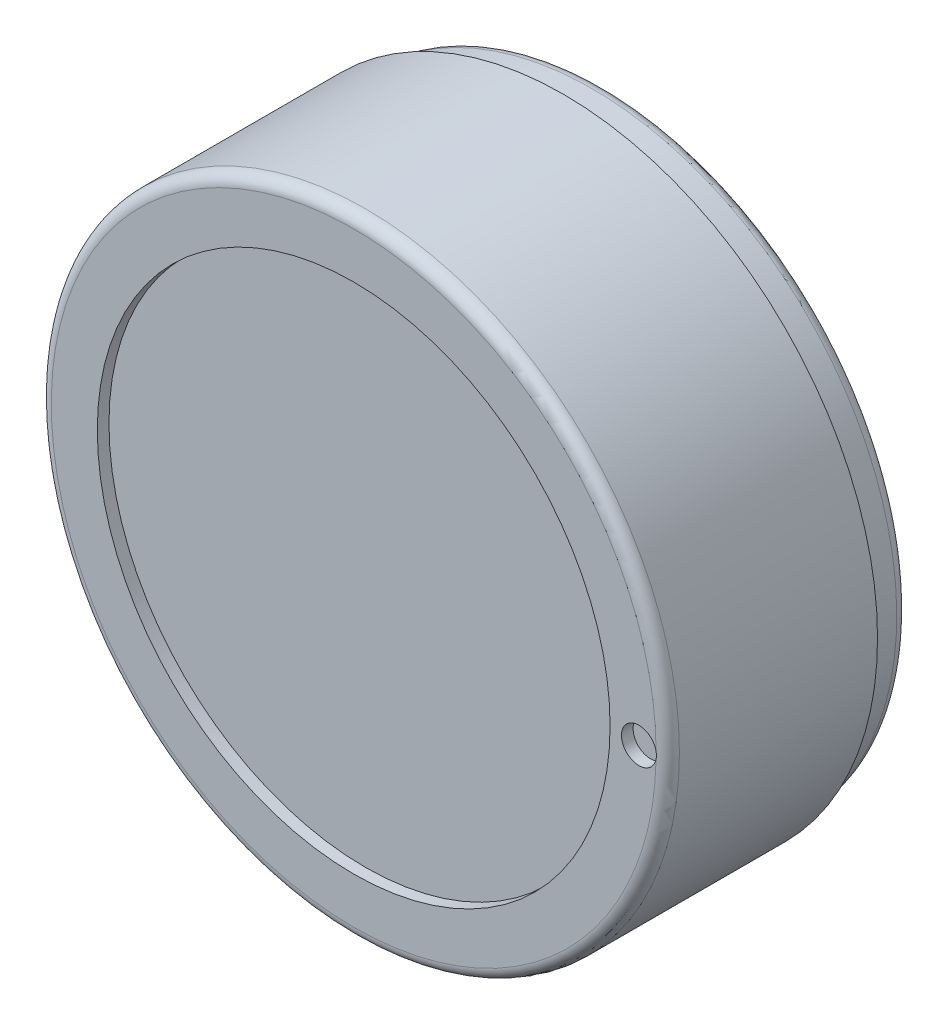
ISO-10303-21;
HEADER;
FILE_DESCRIPTION(('STEP AP214'),'2;1');
FILE_NAME('part.step','',(''),(''),'','','');
FILE_SCHEMA(('AUTOMOTIVE_DESIGN { 1 0 10303 214 1 1 1 1 }'));
ENDSEC;
DATA;
#1=APPLICATION_CONTEXT('core data for automotive mechanical design processes');
#2=APPLICATION_PROTOCOL_DEFINITION('international standard','automotive_design',2000,#1);
#3=PRODUCT_CONTEXT('',#1,'mechanical');
#4=PRODUCT('Part','Part','',(#3));
#5=PRODUCT_RELATED_PRODUCT_CATEGORY('part','',(#4));
#6=PRODUCT_DEFINITION_FORMATION('','',#4);
#7=PRODUCT_DEFINITION_CONTEXT('part definition',#1,'design');
#8=PRODUCT_DEFINITION('design','',#6,#7);
#9=PRODUCT_DEFINITION_SHAPE('','',#8);
#10=(LENGTH_UNIT() NAMED_UNIT(*) SI_UNIT(.MILLI.,.METRE.));
#11=(NAMED_UNIT(*) PLANE_ANGLE_UNIT() SI_UNIT($,.RADIAN.));
#12=(NAMED_UNIT(*) SI_UNIT($,.STERADIAN.) SOLID_ANGLE_UNIT());
#13=UNCERTAINTY_MEASURE_WITH_UNIT(LENGTH_MEASURE(1.E-05),#10,'distance_accuracy_value','');
#14=(GEOMETRIC_REPRESENTATION_CONTEXT(3) GLOBAL_UNCERTAINTY_ASSIGNED_CONTEXT((#13)) GLOBAL_UNIT_ASSIGNED_CONTEXT((#10,
#11,#12)) REPRESENTATION_CONTEXT('',''));
#15=CARTESIAN_POINT('',(0.,0.,0.));
#16=DIRECTION('',(0.,0.,1.));
#17=DIRECTION('',(1.,0.,0.));
#18=AXIS2_PLACEMENT_3D('',#15,#16,#17);
#19=CARTESIAN_POINT('',(-25.9500000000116,0.,21.5));
#20=DIRECTION('',(0.,0.,-1.));
#21=DIRECTION('',(0.,1.,0.));
#22=AXIS2_PLACEMENT_3D('',#19,#20,#21);
#23=PLANE('',#22);
#24=CARTESIAN_POINT('',(0.,0.,21.5));
#25=DIRECTION('',(0.,0.,1.));
#26=DIRECTION('',(0.,-1.,0.));
#27=AXIS2_PLACEMENT_3D('',#24,#25,#26);
#28=CIRCLE('',#27,22.);
#29=CARTESIAN_POINT('',(0.,-22.,21.5));
#30=VERTEX_POINT('',#29);
#31=EDGE_CURVE('E122',#30,#30,#28,.T.);
#32=ORIENTED_EDGE('',*,*,#31,.F.);
#33=EDGE_LOOP('',(#32));
#34=FACE_BOUND('',#33,.T.);
#35=CARTESIAN_POINT('',(24.475,-0.200525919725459,21.5));
#36=DIRECTION('',(0.,0.,-1.));
#37=DIRECTION('',(0.,1.,0.));
#38=AXIS2_PLACEMENT_3D('',#35,#36,#37);
#39=CIRCLE('',#38,1.5);
#40=CARTESIAN_POINT('',(25.9498980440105,0.0727427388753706,21.5));
#41=VERTEX_POINT('',#40);
#42=CARTESIAN_POINT('',(25.945222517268,-0.497924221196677,21.5));
#43=VERTEX_POINT('',#42);
#44=EDGE_CURVE('E120',#41,#43,#39,.F.);
#45=ORIENTED_EDGE('',*,*,#44,.F.);
#46=CARTESIAN_POINT('',(0.,0.,21.5));
#47=DIRECTION('',(0.,0.,1.));
#48=DIRECTION('',(0.,-1.,0.));
#49=AXIS2_PLACEMENT_3D('',#46,#47,#48);
#50=CIRCLE('',#49,25.9500000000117);
#51=EDGE_CURVE('E167',#41,#43,#50,.T.);
#52=ORIENTED_EDGE('',*,*,#51,.T.);
#53=EDGE_LOOP('',(#45,#52));
#54=FACE_BOUND('',#53,.T.);
#55=ADVANCED_FACE('F14',(#34,#54),#23,.F.);
#56=CARTESIAN_POINT('',(0.,0.,20.5));
#57=DIRECTION('',(0.,0.,1.));
#58=DIRECTION('',(0.,-1.,0.));
#59=AXIS2_PLACEMENT_3D('',#56,#57,#58);
#60=TOROIDAL_SURFACE('',#59,25.9500000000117,1.);
#61=CARTESIAN_POINT('',(0.,0.,20.5));
#62=DIRECTION('',(0.,0.,1.));
#63=DIRECTION('',(0.,-1.,0.));
#64=AXIS2_PLACEMENT_3D('',#61,#62,#63);
#65=CIRCLE('',#64,26.9500000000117);
#66=CARTESIAN_POINT('',(0.,-26.9500000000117,20.5));
#67=VERTEX_POINT('',#66);
#68=EDGE_CURVE('E164',#67,#67,#65,.T.);
#69=ORIENTED_EDGE('',*,*,#68,.T.);
#70=EDGE_LOOP('',(#69));
#71=FACE_BOUND('',#70,.T.);
#72=ORIENTED_EDGE('',*,*,#51,.F.);
#73=CARTESIAN_POINT('',(24.9195600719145,1.23208231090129,20.4998));
#74=CARTESIAN_POINT('',(24.9195545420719,1.23208007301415,20.525852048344));
#75=CARTESIAN_POINT('',(24.920585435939,1.23176459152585,20.551892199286));
#76=CARTESIAN_POINT('',(24.9247058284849,1.23047774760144,20.6037939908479));
#77=CARTESIAN_POINT('',(24.9277954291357,1.22950635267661,20.6296556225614));
#78=CARTESIAN_POINT('',(24.9401284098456,1.2255650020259,20.7067220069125));
#79=CARTESIAN_POINT('',(24.9524359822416,1.22156791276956,20.7574233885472));
#80=CARTESIAN_POINT('',(24.9847688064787,1.21029865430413,20.8559651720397));
#81=CARTESIAN_POINT('',(25.004803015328,1.20302268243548,20.903802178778));
#82=CARTESIAN_POINT('',(25.051691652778,1.18441423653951,20.9951127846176));
#83=CARTESIAN_POINT('',(25.0785396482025,1.17308558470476,21.0385904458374));
#84=CARTESIAN_POINT('',(25.1370749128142,1.14582956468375,21.1191056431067));
#85=CARTESIAN_POINT('',(25.1686520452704,1.13000093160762,21.156256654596));
#86=CARTESIAN_POINT('',(25.2352696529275,1.09308741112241,21.2243114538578));
#87=CARTESIAN_POINT('',(25.2703100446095,1.07200265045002,21.2552153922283));
#88=CARTESIAN_POINT('',(25.3412120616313,1.0248135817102,21.3099755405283));
#89=CARTESIAN_POINT('',(25.3770493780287,0.998801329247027,21.3339432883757));
#90=CARTESIAN_POINT('',(25.4482605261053,0.941772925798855,21.3758135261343));
#91=CARTESIAN_POINT('',(25.4836342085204,0.910755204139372,21.3937141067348));
#92=CARTESIAN_POINT('',(25.5551642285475,0.841547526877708,21.4254154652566));
#93=CARTESIAN_POINT('',(25.5911518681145,0.802980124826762,21.4387667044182));
#94=CARTESIAN_POINT('',(25.6594130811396,0.721429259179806,21.4604859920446));
#95=CARTESIAN_POINT('',(25.6916844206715,0.678443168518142,21.4688510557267));
#96=CARTESIAN_POINT('',(25.7575138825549,0.580058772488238,21.4831865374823));
#97=CARTESIAN_POINT('',(25.7900786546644,0.52388130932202,21.4883633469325));
#98=CARTESIAN_POINT('',(25.8477293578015,0.407616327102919,21.4954688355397));
#99=CARTESIAN_POINT('',(25.8728092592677,0.347525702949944,21.4973949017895));
#100=CARTESIAN_POINT('',(25.9192817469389,0.211991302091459,21.4998578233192));
#101=CARTESIAN_POINT('',(25.9388753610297,0.135918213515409,21.5000306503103));
#102=CARTESIAN_POINT('',(25.965956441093,-0.0183478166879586,21.4999631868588));
#103=CARTESIAN_POINT('',(25.973441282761,-0.096541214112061,21.4997228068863));
#104=CARTESIAN_POINT('',(25.9762180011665,-0.258938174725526,21.4996302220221));
#105=CARTESIAN_POINT('',(25.9705698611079,-0.343159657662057,21.4998079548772));
#106=CARTESIAN_POINT('',(25.9452387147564,-0.509533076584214,21.5000619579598));
#107=CARTESIAN_POINT('',(25.9255439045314,-0.591683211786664,21.5001381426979));
#108=CARTESIAN_POINT('',(25.8725748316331,-0.751822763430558,21.4980776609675));
#109=CARTESIAN_POINT('',(25.8392482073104,-0.829794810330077,21.4959324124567));
#110=CARTESIAN_POINT('',(25.7601101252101,-0.978701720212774,21.4859004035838));
#111=CARTESIAN_POINT('',(25.7143210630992,-1.04964889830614,21.4780239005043));
#112=CARTESIAN_POINT('',(25.6273450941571,-1.16261886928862,21.4557293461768));
#113=CARTESIAN_POINT('',(25.5886577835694,-1.20707231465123,21.4438623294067));
#114=CARTESIAN_POINT('',(25.507724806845,-1.28993796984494,21.4131471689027));
#115=CARTESIAN_POINT('',(25.4654828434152,-1.3283563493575,21.3943062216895));
#116=CARTESIAN_POINT('',(25.3793964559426,-1.39851419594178,21.347984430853));
#117=CARTESIAN_POINT('',(25.3355413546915,-1.43019321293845,21.3204304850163));
#118=CARTESIAN_POINT('',(25.2497934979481,-1.48594906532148,21.2560931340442));
#119=CARTESIAN_POINT('',(25.2078994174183,-1.51003109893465,21.2193160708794));
#120=CARTESIAN_POINT('',(25.1348222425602,-1.54815449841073,21.1428028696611));
#121=CARTESIAN_POINT('',(25.1029584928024,-1.56312134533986,21.1041696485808));
#122=CARTESIAN_POINT('',(25.0449410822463,-1.58839165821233,21.0214532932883));
#123=CARTESIAN_POINT('',(25.0187887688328,-1.59869402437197,20.9773688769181));
#124=CARTESIAN_POINT('',(24.9742665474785,-1.61519198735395,20.8866347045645));
#125=CARTESIAN_POINT('',(24.9556651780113,-1.62151365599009,20.8401204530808));
#126=CARTESIAN_POINT('',(24.9257546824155,-1.63128449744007,20.7445423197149));
#127=CARTESIAN_POINT('',(24.9144392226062,-1.63473616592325,20.6954806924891));
#128=CARTESIAN_POINT('',(24.9033103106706,-1.6380802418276,20.6216641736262));
#129=CARTESIAN_POINT('',(24.9005742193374,-1.63889018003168,20.5973544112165));
#130=CARTESIAN_POINT('',(24.8969318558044,-1.63996176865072,20.548633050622));
#131=CARTESIAN_POINT('',(24.8960220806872,-1.64022446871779,20.5242217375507));
#132=CARTESIAN_POINT('',(24.8960269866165,-1.64022598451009,20.4998));
#133=B_SPLINE_CURVE_WITH_KNOTS('',3,(#73,#74,#75,#76,#77,#78,#79,#80,#81,#82,#83,#84,#85,#86,
#87,#88,#89,#90,#91,#92,#93,#94,#95,#96,#97,#98,#99,#100,#101,#102,#103,#104,#105,#106,#107,
#108,#109,#110,#111,#112,#113,#114,#115,#116,#117,#118,#119,#120,#121,#122,#123,#124,#125,#126,
#127,#128,#129,#130,#131,#132),.UNSPECIFIED.,.F.,.F.,(4,2,2,2,2,2,2,2,2,2,2,2,2,2,2,2,2,2,2,2,2,
2,2,2,2,2,2,2,2,4),(0.,0.0781093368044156,0.156222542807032,0.312404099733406,0.468767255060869,
0.624983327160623,0.778006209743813,0.931025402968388,1.0814264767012,1.23187483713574,
1.39450970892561,1.5572418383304,1.75195274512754,1.94682008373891,2.18148282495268,
2.41619641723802,2.66822146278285,2.92045854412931,3.17367373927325,3.42643686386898,
3.60609054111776,3.78555934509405,3.96657573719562,4.14746799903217,4.30347750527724,
4.45952377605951,4.61033989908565,4.76102473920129,4.8343909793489,4.90761636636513),.UNSPECIFIED.);
#134=EDGE_CURVE('E170',#41,#43,#133,.T.);
#135=ORIENTED_EDGE('',*,*,#134,.T.);
#136=EDGE_LOOP('',(#72,#135));
#137=FACE_BOUND('',#136,.T.);
#138=ADVANCED_FACE('F184',(#71,#137),#60,.T.);
#139=CARTESIAN_POINT('',(0.,0.,31.8085085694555));
#140=DIRECTION('',(0.,0.,1.));
#141=DIRECTION('',(0.,-1.,0.));
#142=AXIS2_PLACEMENT_3D('',#139,#140,#141);
#143=CYLINDRICAL_SURFACE('',#142,26.9500000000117);
#144=CARTESIAN_POINT('',(0.,0.,3.5));
#145=DIRECTION('',(0.,0.,1.));
#146=DIRECTION('',(0.,-1.,0.));
#147=AXIS2_PLACEMENT_3D('',#144,#145,#146);
#148=CIRCLE('',#147,26.9500000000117);
#149=CARTESIAN_POINT('',(0.,-26.9500000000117,3.5));
#150=VERTEX_POINT('',#149);
#151=EDGE_CURVE('E161',#150,#150,#148,.T.);
#152=ORIENTED_EDGE('',*,*,#151,.T.);
#153=EDGE_LOOP('',(#152));
#154=FACE_BOUND('',#153,.T.);
#155=ORIENTED_EDGE('',*,*,#68,.F.);
#156=EDGE_LOOP('',(#155));
#157=FACE_BOUND('',#156,.T.);
#158=ADVANCED_FACE('F292',(#154,#157),#143,.T.);
#159=CARTESIAN_POINT('',(-26.9500000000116,0.,3.5));
#160=DIRECTION('',(0.,0.,-1.));
#161=DIRECTION('',(0.,1.,0.));
#162=AXIS2_PLACEMENT_3D('',#159,#160,#161);
#163=PLANE('',#162);
#164=CARTESIAN_POINT('',(0.,0.,3.5));
#165=DIRECTION('',(0.,0.,1.));
#166=DIRECTION('',(0.,-1.,0.));
#167=AXIS2_PLACEMENT_3D('',#164,#165,#166);
#168=CIRCLE('',#167,26.1);
#169=CARTESIAN_POINT('',(0.,-26.1,3.5));
#170=VERTEX_POINT('',#169);
#171=EDGE_CURVE('E158',#170,#170,#168,.T.);
#172=ORIENTED_EDGE('',*,*,#171,.T.);
#173=EDGE_LOOP('',(#172));
#174=FACE_BOUND('',#173,.T.);
#175=ORIENTED_EDGE('',*,*,#151,.F.);
#176=EDGE_LOOP('',(#175));
#177=FACE_BOUND('',#176,.T.);
#178=ADVANCED_FACE('F305',(#174,#177),#163,.T.);
#179=CARTESIAN_POINT('',(0.,0.,31.8085085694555));
#180=DIRECTION('',(0.,0.,1.));
#181=DIRECTION('',(0.,-1.,0.));
#182=AXIS2_PLACEMENT_3D('',#179,#180,#181);
#183=CYLINDRICAL_SURFACE('',#182,26.1);
#184=ORIENTED_EDGE('',*,*,#171,.F.);
#185=EDGE_LOOP('',(#184));
#186=FACE_BOUND('',#185,.T.);
#187=CARTESIAN_POINT('',(0.,0.,1.));
#188=DIRECTION('',(0.,0.,1.));
#189=DIRECTION('',(0.,-1.,0.));
#190=AXIS2_PLACEMENT_3D('',#187,#188,#189);
#191=CIRCLE('',#190,26.1);
#192=CARTESIAN_POINT('',(0.,-26.1,1.));
#193=VERTEX_POINT('',#192);
#194=EDGE_CURVE('E155',#193,#193,#191,.T.);
#195=ORIENTED_EDGE('',*,*,#194,.T.);
#196=EDGE_LOOP('',(#195));
#197=FACE_BOUND('',#196,.T.);
#198=ADVANCED_FACE('F313',(#186,#197),#183,.T.);
#199=CARTESIAN_POINT('',(0.,0.,1.));
#200=DIRECTION('',(0.,0.,1.));
#201=DIRECTION('',(0.,-1.,0.));
#202=AXIS2_PLACEMENT_3D('',#199,#200,#201);
#203=TOROIDAL_SURFACE('',#202,25.1,1.);
#204=CARTESIAN_POINT('',(0.,0.,0.));
#205=DIRECTION('',(0.,0.,1.));
#206=DIRECTION('',(0.,-1.,0.));
#207=AXIS2_PLACEMENT_3D('',#204,#205,#206);
#208=CIRCLE('',#207,25.1);
#209=CARTESIAN_POINT('',(0.,-25.1,0.));
#210=VERTEX_POINT('',#209);
#211=EDGE_CURVE('E152',#210,#210,#208,.T.);
#212=ORIENTED_EDGE('',*,*,#211,.T.);
#213=EDGE_LOOP('',(#212));
#214=FACE_BOUND('',#213,.T.);
#215=ORIENTED_EDGE('',*,*,#194,.F.);
#216=EDGE_LOOP('',(#215));
#217=FACE_BOUND('',#216,.T.);
#218=ADVANCED_FACE('F319',(#214,#217),#203,.T.);
#219=CARTESIAN_POINT('',(-25.1,0.,0.));
#220=DIRECTION('',(0.,0.,-1.));
#221=DIRECTION('',(0.,1.,0.));
#222=AXIS2_PLACEMENT_3D('',#219,#220,#221);
#223=PLANE('',#222);
#224=CARTESIAN_POINT('',(0.,0.,0.));
#225=DIRECTION('',(0.,0.,1.));
#226=DIRECTION('',(0.,-1.,0.));
#227=AXIS2_PLACEMENT_3D('',#224,#225,#226);
#228=CIRCLE('',#227,5.);
#229=CARTESIAN_POINT('',(0.,-5.,0.));
#230=VERTEX_POINT('',#229);
#231=EDGE_CURVE('E149',#230,#230,#228,.T.);
#232=ORIENTED_EDGE('',*,*,#231,.T.);
#233=EDGE_LOOP('',(#232));
#234=FACE_BOUND('',#233,.T.);
#235=ORIENTED_EDGE('',*,*,#211,.F.);
#236=EDGE_LOOP('',(#235));
#237=FACE_BOUND('',#236,.T.);
#238=ADVANCED_FACE('F323',(#234,#237),#223,.T.);
#239=CARTESIAN_POINT('',(0.,0.,31.8085085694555));
#240=DIRECTION('',(0.,0.,1.));
#241=DIRECTION('',(0.,-1.,0.));
#242=AXIS2_PLACEMENT_3D('',#239,#240,#241);
#243=CYLINDRICAL_SURFACE('',#242,5.);
#244=ORIENTED_EDGE('',*,*,#231,.F.);
#245=EDGE_LOOP('',(#244));
#246=FACE_BOUND('',#245,.T.);
#247=CARTESIAN_POINT('',(0.,0.,-0.5));
#248=DIRECTION('',(0.,0.,1.));
#249=DIRECTION('',(0.,-1.,0.));
#250=AXIS2_PLACEMENT_3D('',#247,#248,#249);
#251=CIRCLE('',#250,5.);
#252=CARTESIAN_POINT('',(0.,-5.,-0.5));
#253=VERTEX_POINT('',#252);
#254=EDGE_CURVE('E146',#253,#253,#251,.T.);
#255=ORIENTED_EDGE('',*,*,#254,.T.);
#256=EDGE_LOOP('',(#255));
#257=FACE_BOUND('',#256,.T.);
#258=ADVANCED_FACE('F326',(#246,#257),#243,.T.);
#259=CARTESIAN_POINT('',(-5.,0.,-0.5));
#260=DIRECTION('',(0.,0.,-1.));
#261=DIRECTION('',(0.,1.,0.));
#262=AXIS2_PLACEMENT_3D('',#259,#260,#261);
#263=PLANE('',#262);
#264=ORIENTED_EDGE('',*,*,#254,.F.);
#265=EDGE_LOOP('',(#264));
#266=FACE_BOUND('',#265,.T.);
#267=DIRECTION('',(-1.,0.,0.));
#268=VECTOR('',#267,1.);
#269=CARTESIAN_POINT('',(2.02072594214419,-3.49999999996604,-0.5));
#270=LINE('',#269,#268);
#271=CARTESIAN_POINT('',(2.020725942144,-3.49999999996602,-0.5));
#272=VERTEX_POINT('',#271);
#273=CARTESIAN_POINT('',(-2.020725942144,-3.49999999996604,-0.5));
#274=VERTEX_POINT('',#273);
#275=EDGE_CURVE('E105',#272,#274,#270,.T.);
#276=ORIENTED_EDGE('',*,*,#275,.F.);
#277=DIRECTION('',(0.5,0.866025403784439,0.));
#278=VECTOR('',#277,1.);
#279=CARTESIAN_POINT('',(2.02072594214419,-3.49999999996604,-0.5));
#280=LINE('',#279,#278);
#281=CARTESIAN_POINT('',(4.04145188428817,0.,-0.5));
#282=VERTEX_POINT('',#281);
#283=EDGE_CURVE('E34',#272,#282,#280,.T.);
#284=ORIENTED_EDGE('',*,*,#283,.T.);
#285=DIRECTION('',(0.5,-0.866025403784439,0.));
#286=VECTOR('',#285,1.);
#287=CARTESIAN_POINT('',(2.02072594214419,3.49999999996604,-0.5));
#288=LINE('',#287,#286);
#289=CARTESIAN_POINT('',(2.02072594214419,3.49999999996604,-0.5));
#290=VERTEX_POINT('',#289);
#291=EDGE_CURVE('E80',#290,#282,#288,.T.);
#292=ORIENTED_EDGE('',*,*,#291,.F.);
#293=DIRECTION('',(-1.,0.,0.));
#294=VECTOR('',#293,1.);
#295=CARTESIAN_POINT('',(2.02072594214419,3.49999999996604,-0.5));
#296=LINE('',#295,#294);
#297=CARTESIAN_POINT('',(-2.020725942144,3.49999999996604,-0.5));
#298=VERTEX_POINT('',#297);
#299=EDGE_CURVE('E92',#290,#298,#296,.T.);
#300=ORIENTED_EDGE('',*,*,#299,.T.);
#301=DIRECTION('',(-0.5,-0.866025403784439,0.));
#302=VECTOR('',#301,1.);
#303=CARTESIAN_POINT('',(-2.020725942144,3.49999999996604,-0.5));
#304=LINE('',#303,#302);
#305=CARTESIAN_POINT('',(-4.04145188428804,0.,-0.5));
#306=VERTEX_POINT('',#305);
#307=EDGE_CURVE('E97',#298,#306,#304,.T.);
#308=ORIENTED_EDGE('',*,*,#307,.T.);
#309=DIRECTION('',(-0.5,0.866025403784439,0.));
#310=VECTOR('',#309,1.);
#311=CARTESIAN_POINT('',(-2.020725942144,-3.49999999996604,-0.5));
#312=LINE('',#311,#310);
#313=EDGE_CURVE('E99',#274,#306,#312,.T.);
#314=ORIENTED_EDGE('',*,*,#313,.F.);
#315=EDGE_LOOP('',(#276,#284,#292,#300,#308,#314));
#316=FACE_BOUND('',#315,.T.);
#317=ADVANCED_FACE('F90',(#266,#316),#263,.T.);
#318=CARTESIAN_POINT('',(0.,0.,20.5));
#319=DIRECTION('',(0.,0.,1.));
#320=DIRECTION('',(0.,-1.,0.));
#321=AXIS2_PLACEMENT_3D('',#318,#319,#320);
#322=CYLINDRICAL_SURFACE('',#321,22.);
#323=CARTESIAN_POINT('',(0.,0.,20.5));
#324=DIRECTION('',(0.,0.,1.));
#325=DIRECTION('',(0.,-1.,0.));
#326=AXIS2_PLACEMENT_3D('',#323,#324,#325);
#327=CIRCLE('',#326,22.);
#328=CARTESIAN_POINT('',(0.,-22.,20.5));
#329=VERTEX_POINT('',#328);
#330=EDGE_CURVE('E125',#329,#329,#327,.T.);
#331=ORIENTED_EDGE('',*,*,#330,.F.);
#332=EDGE_LOOP('',(#331));
#333=FACE_BOUND('',#332,.T.);
#334=ORIENTED_EDGE('',*,*,#31,.T.);
#335=EDGE_LOOP('',(#334));
#336=FACE_BOUND('',#335,.T.);
#337=ADVANCED_FACE('F195',(#333,#336),#322,.F.);
#338=CARTESIAN_POINT('',(0.,0.,20.5));
#339=DIRECTION('',(0.,0.,1.));
#340=DIRECTION('',(0.,-1.,0.));
#341=AXIS2_PLACEMENT_3D('',#338,#339,#340);
#342=PLANE('',#341);
#343=ORIENTED_EDGE('',*,*,#330,.T.);
#344=EDGE_LOOP('',(#343));
#345=FACE_BOUND('',#344,.T.);
#346=ADVANCED_FACE('F193',(#345),#342,.T.);
#347=CARTESIAN_POINT('',(24.475,-0.200525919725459,50.5));
#348=DIRECTION('',(0.,0.,-1.));
#349=DIRECTION('',(0.,1.,0.));
#350=AXIS2_PLACEMENT_3D('',#347,#348,#349);
#351=CYLINDRICAL_SURFACE('',#350,1.5);
#352=CARTESIAN_POINT('',(24.475,-0.200525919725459,20.5));
#353=DIRECTION('',(0.,0.,1.));
#354=DIRECTION('',(0.,-1.,0.));
#355=AXIS2_PLACEMENT_3D('',#352,#353,#354);
#356=CIRCLE('',#355,1.5);
#357=CARTESIAN_POINT('',(24.475,-1.70052591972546,20.5));
#358=VERTEX_POINT('',#357);
#359=EDGE_CURVE('E117',#358,#358,#356,.T.);
#360=ORIENTED_EDGE('',*,*,#359,.F.);
#361=EDGE_LOOP('',(#360));
#362=FACE_BOUND('',#361,.T.);
#363=ORIENTED_EDGE('',*,*,#44,.T.);
#364=ORIENTED_EDGE('',*,*,#134,.F.);
#365=EDGE_LOOP('',(#363,#364));
#366=FACE_BOUND('',#365,.T.);
#367=ADVANCED_FACE('F187',(#362,#366),#351,.F.);
#368=CARTESIAN_POINT('',(24.475,-0.200525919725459,20.5));
#369=DIRECTION('',(0.,0.,1.));
#370=DIRECTION('',(0.,-1.,0.));
#371=AXIS2_PLACEMENT_3D('',#368,#369,#370);
#372=PLANE('',#371);
#373=ORIENTED_EDGE('',*,*,#359,.T.);
#374=EDGE_LOOP('',(#373));
#375=FACE_BOUND('',#374,.T.);
#376=ADVANCED_FACE('F192',(#375),#372,.T.);
#377=CARTESIAN_POINT('',(2.02072594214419,-3.49999999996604,-10.5));
#378=DIRECTION('',(0.866025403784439,-0.5,0.));
#379=DIRECTION('',(-0.5,-0.866025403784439,0.));
#380=AXIS2_PLACEMENT_3D('',#377,#378,#379);
#381=PLANE('',#380);
#382=DIRECTION('',(0.,0.,1.));
#383=VECTOR('',#382,1.);
#384=CARTESIAN_POINT('',(4.04145188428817,0.,-10.5));
#385=LINE('',#384,#383);
#386=CARTESIAN_POINT('',(4.04145188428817,0.,-2.52965758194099));
#387=VERTEX_POINT('',#386);
#388=EDGE_CURVE('E41',#387,#282,#385,.T.);
#389=ORIENTED_EDGE('',*,*,#388,.T.);
#390=ORIENTED_EDGE('',*,*,#283,.F.);
#391=DIRECTION('',(0.,0.,1.));
#392=VECTOR('',#391,1.);
#393=CARTESIAN_POINT('',(2.02072594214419,-3.49999999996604,-10.5));
#394=LINE('',#393,#392);
#395=CARTESIAN_POINT('',(2.02072594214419,-3.49999999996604,-2.52965758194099));
#396=VERTEX_POINT('',#395);
#397=EDGE_CURVE('E114',#396,#272,#394,.T.);
#398=ORIENTED_EDGE('',*,*,#397,.F.);
#399=CARTESIAN_POINT('',(4.04156735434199,0.000200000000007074,-2.529590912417));
#400=CARTESIAN_POINT('',(3.95276673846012,-0.153607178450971,-2.58087918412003));
#401=CARTESIAN_POINT('',(3.86319960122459,-0.308742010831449,-2.62752401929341));
#402=CARTESIAN_POINT('',(3.68251437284,-0.621698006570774,-2.70894309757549));
#403=CARTESIAN_POINT('',(3.5913930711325,-0.779524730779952,-2.74368853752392));
#404=CARTESIAN_POINT('',(3.41027974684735,-1.09322221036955,-2.79777494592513));
#405=CARTESIAN_POINT('',(3.32031559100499,-1.24904469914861,-2.81747588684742));
#406=CARTESIAN_POINT('',(3.13996396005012,-1.56142288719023,-2.84099484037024));
#407=CARTESIAN_POINT('',(3.04957714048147,-1.71797745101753,-2.84483232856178));
#408=CARTESIAN_POINT('',(2.88068384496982,-2.01050921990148,-2.83684967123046));
#409=CARTESIAN_POINT('',(2.80215208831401,-2.14653021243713,-2.82698953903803));
#410=CARTESIAN_POINT('',(2.64560020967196,-2.41768602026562,-2.79573850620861));
#411=CARTESIAN_POINT('',(2.56758062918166,-2.55281989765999,-2.77433692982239));
#412=CARTESIAN_POINT('',(2.41070596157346,-2.82453479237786,-2.72083456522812));
#413=CARTESIAN_POINT('',(2.33187072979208,-2.9610814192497,-2.68850697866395));
#414=CARTESIAN_POINT('',(2.17537608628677,-3.23213809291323,-2.61513603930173));
#415=CARTESIAN_POINT('',(2.09771466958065,-3.36665161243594,-2.5741099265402));
#416=CARTESIAN_POINT('',(2.02061047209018,-3.50019999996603,-2.529590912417));
#417=B_SPLINE_CURVE_WITH_KNOTS('',3,(#399,#400,#401,#402,#403,#404,#405,#406,#407,#408,#409,
#410,#411,#412,#413,#414,#415,#416),.UNSPECIFIED.,.F.,.F.,(4,2,2,2,2,2,2,2,4),(0.,
0.554793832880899,1.11092123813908,1.65328467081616,2.19498204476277,2.66665130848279,
3.13875761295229,3.62133612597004,4.10296698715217),.UNSPECIFIED.);
#418=EDGE_CURVE('E9',#387,#396,#417,.T.);
#419=ORIENTED_EDGE('',*,*,#418,.F.);
#420=EDGE_LOOP('',(#389,#390,#398,#419));
#421=FACE_BOUND('',#420,.T.);
#422=ADVANCED_FACE('F265',(#421),#381,.T.);
#423=CARTESIAN_POINT('',(2.02072594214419,-3.49999999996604,-10.5));
#424=DIRECTION('',(0.,1.,0.));
#425=DIRECTION('',(0.,0.,1.));
#426=AXIS2_PLACEMENT_3D('',#423,#424,#425);
#427=PLANE('',#426);
#428=CARTESIAN_POINT('',(-5.35125920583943,-3.49999999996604,-1.17128963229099));
#429=CARTESIAN_POINT('',(-5.19765156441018,-3.49999999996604,-1.24548805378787));
#430=CARTESIAN_POINT('',(-5.04367983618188,-3.49999999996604,-1.31894642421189));
#431=CARTESIAN_POINT('',(-4.73481130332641,-3.49999999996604,-1.46395998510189));
#432=CARTESIAN_POINT('',(-4.579914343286,-3.49999999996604,-1.53551484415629));
#433=CARTESIAN_POINT('',(-4.26815774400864,-3.49999999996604,-1.67667700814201));
#434=CARTESIAN_POINT('',(-4.11129194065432,-3.49999999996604,-1.74627074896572));
#435=CARTESIAN_POINT('',(-3.79626807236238,-3.49999999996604,-1.8824574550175));
#436=CARTESIAN_POINT('',(-3.63811007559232,-3.49999999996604,-1.94905057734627));
#437=CARTESIAN_POINT('',(-3.31832417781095,-3.49999999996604,-2.07921312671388));
#438=CARTESIAN_POINT('',(-3.15667742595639,-3.49999999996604,-2.14273649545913));
#439=CARTESIAN_POINT('',(-2.83147443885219,-3.49999999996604,-2.26478807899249));
#440=CARTESIAN_POINT('',(-2.66791799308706,-3.49999999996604,-2.32331573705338));
#441=CARTESIAN_POINT('',(-2.33897401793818,-3.49999999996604,-2.43379742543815));
#442=CARTESIAN_POINT('',(-2.1735912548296,-3.49999999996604,-2.48576550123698));
#443=CARTESIAN_POINT('',(-1.84047500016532,-3.49999999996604,-2.58143509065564));
#444=CARTESIAN_POINT('',(-1.67274227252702,-3.49999999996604,-2.62513922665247));
#445=CARTESIAN_POINT('',(-1.3348082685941,-3.49999999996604,-2.70215491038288));
#446=CARTESIAN_POINT('',(-1.16460625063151,-3.49999999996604,-2.73546326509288));
#447=CARTESIAN_POINT('',(-0.822159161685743,-3.49999999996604,-2.7894378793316));
#448=CARTESIAN_POINT('',(-0.649914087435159,-3.49999999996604,-2.81010411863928));
#449=CARTESIAN_POINT('',(-0.305367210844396,-3.49999999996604,-2.83696606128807));
#450=CARTESIAN_POINT('',(-0.133072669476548,-3.49999999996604,-2.84325253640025));
#451=CARTESIAN_POINT('',(0.211382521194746,-3.49999999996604,-2.84102452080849));
#452=CARTESIAN_POINT('',(0.383543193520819,-3.49999999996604,-2.83251383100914));
#453=CARTESIAN_POINT('',(0.677785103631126,-3.49999999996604,-2.80591966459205));
#454=CARTESIAN_POINT('',(0.800191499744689,-3.49999999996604,-2.79124480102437));
#455=CARTESIAN_POINT('',(1.04405334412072,-3.49999999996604,-2.75537347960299));
#456=CARTESIAN_POINT('',(1.16550863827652,-3.49999999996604,-2.73417598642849));
#457=CARTESIAN_POINT('',(1.52835176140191,-3.49999999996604,-2.66191271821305));
#458=CARTESIAN_POINT('',(1.76803258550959,-3.49999999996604,-2.60219494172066));
#459=CARTESIAN_POINT('',(2.12666286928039,-3.49999999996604,-2.49926608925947));
#460=CARTESIAN_POINT('',(2.24748336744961,-3.49999999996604,-2.46220910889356));
#461=CARTESIAN_POINT('',(2.48786312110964,-3.49999999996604,-2.38444536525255));
#462=CARTESIAN_POINT('',(2.60742318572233,-3.49999999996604,-2.34374112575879));
#463=CARTESIAN_POINT('',(2.8447820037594,-3.49999999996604,-2.25952849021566));
#464=CARTESIAN_POINT('',(2.96258688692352,-3.49999999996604,-2.21603719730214));
#465=CARTESIAN_POINT('',(3.19728410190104,-3.49999999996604,-2.12651293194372));
#466=CARTESIAN_POINT('',(3.31417604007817,-3.49999999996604,-2.08047892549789));
#467=CARTESIAN_POINT('',(3.43064607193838,-3.49999999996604,-2.03342484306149));
#468=B_SPLINE_CURVE_WITH_KNOTS('',3,(#428,#429,#430,#431,#432,#433,#434,#435,#436,#437,#438,
#439,#440,#441,#442,#443,#444,#445,#446,#447,#448,#449,#450,#451,#452,#453,#454,#455,#456,#457,
#458,#459,#460,#461,#462,#463,#464,#465,#466,#467),.UNSPECIFIED.,.F.,.F.,(4,2,2,2,2,2,2,2,2,2,2,
2,2,2,2,2,2,2,2,4),(0.,0.511774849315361,1.02363822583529,1.53844479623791,2.05322438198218,
2.57420186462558,3.09523732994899,3.61513750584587,4.13487242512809,4.6547668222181,
5.17466205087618,5.69126629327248,6.20773785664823,6.57740592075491,6.94713269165,
7.6871393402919,8.06623653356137,8.44507340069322,8.82177445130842,9.19862983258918),.UNSPECIFIED.);
#469=CARTESIAN_POINT('',(-2.020725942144,-3.49999999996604,-2.52965758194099));
#470=VERTEX_POINT('',#469);
#471=EDGE_CURVE('E27',#470,#396,#468,.T.);
#472=ORIENTED_EDGE('',*,*,#471,.T.);
#473=ORIENTED_EDGE('',*,*,#397,.T.);
#474=ORIENTED_EDGE('',*,*,#275,.T.);
#475=DIRECTION('',(0.,0.,1.));
#476=VECTOR('',#475,1.);
#477=CARTESIAN_POINT('',(-2.020725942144,-3.49999999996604,-10.5));
#478=LINE('',#477,#476);
#479=EDGE_CURVE('E112',#470,#274,#478,.T.);
#480=ORIENTED_EDGE('',*,*,#479,.F.);
#481=EDGE_LOOP('',(#472,#473,#474,#480));
#482=FACE_BOUND('',#481,.T.);
#483=ADVANCED_FACE('F261',(#482),#427,.F.);
#484=CARTESIAN_POINT('',(-2.020725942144,-3.49999999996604,-10.5));
#485=DIRECTION('',(0.866025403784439,0.5,0.));
#486=DIRECTION('',(0.5,-0.866025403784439,0.));
#487=AXIS2_PLACEMENT_3D('',#484,#485,#486);
#488=PLANE('',#487);
#489=CARTESIAN_POINT('',(-4.04156735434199,0.000200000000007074,-2.529590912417));
#490=CARTESIAN_POINT('',(-3.95276673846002,-0.153607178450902,-2.58087918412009));
#491=CARTESIAN_POINT('',(-3.86319960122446,-0.308742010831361,-2.62752401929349));
#492=CARTESIAN_POINT('',(-3.68251437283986,-0.621698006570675,-2.70894309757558));
#493=CARTESIAN_POINT('',(-3.59139307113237,-0.779524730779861,-2.743688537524));
#494=CARTESIAN_POINT('',(-3.41027974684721,-1.09322221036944,-2.79777494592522));
#495=CARTESIAN_POINT('',(-3.32031559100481,-1.24904469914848,-2.81747588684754));
#496=CARTESIAN_POINT('',(-3.13996396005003,-1.56142288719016,-2.84099484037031));
#497=CARTESIAN_POINT('',(-3.0495771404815,-1.71797745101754,-2.84483232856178));
#498=CARTESIAN_POINT('',(-2.88068384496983,-2.01050921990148,-2.83684967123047));
#499=CARTESIAN_POINT('',(-2.80215208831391,-2.14653021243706,-2.8269895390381));
#500=CARTESIAN_POINT('',(-2.64560020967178,-2.41768602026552,-2.79573850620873));
#501=CARTESIAN_POINT('',(-2.56758062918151,-2.5528198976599,-2.77433692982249));
#502=CARTESIAN_POINT('',(-2.41070596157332,-2.82453479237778,-2.72083456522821));
#503=CARTESIAN_POINT('',(-2.33187072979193,-2.96108141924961,-2.68850697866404));
#504=CARTESIAN_POINT('',(-2.17537608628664,-3.23213809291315,-2.61513603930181));
#505=CARTESIAN_POINT('',(-2.09771466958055,-3.36665161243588,-2.57410992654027));
#506=CARTESIAN_POINT('',(-2.02061047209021,-3.50019999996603,-2.529590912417));
#507=B_SPLINE_CURVE_WITH_KNOTS('',3,(#489,#490,#491,#492,#493,#494,#495,#496,#497,#498,#499,
#500,#501,#502,#503,#504,#505,#506),.UNSPECIFIED.,.F.,.F.,(4,2,2,2,2,2,2,2,4),(0.,
0.554793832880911,1.11092123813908,1.65328467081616,2.19498204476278,2.6666513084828,
3.13875761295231,3.62133612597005,4.1029669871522),.UNSPECIFIED.);
#508=CARTESIAN_POINT('',(-4.04145188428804,0.,-2.52965758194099));
#509=VERTEX_POINT('',#508);
#510=EDGE_CURVE('E251',#509,#470,#507,.T.);
#511=ORIENTED_EDGE('',*,*,#510,.T.);
#512=ORIENTED_EDGE('',*,*,#479,.T.);
#513=ORIENTED_EDGE('',*,*,#313,.T.);
#514=DIRECTION('',(0.,0.,1.));
#515=VECTOR('',#514,1.);
#516=CARTESIAN_POINT('',(-4.04145188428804,0.,-10.5));
#517=LINE('',#516,#515);
#518=EDGE_CURVE('E110',#509,#306,#517,.T.);
#519=ORIENTED_EDGE('',*,*,#518,.F.);
#520=EDGE_LOOP('',(#511,#512,#513,#519));
#521=FACE_BOUND('',#520,.T.);
#522=ADVANCED_FACE('F264',(#521),#488,.F.);
#523=CARTESIAN_POINT('',(-2.020725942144,3.49999999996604,-10.5));
#524=DIRECTION('',(-0.866025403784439,0.5,0.));
#525=DIRECTION('',(0.5,0.866025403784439,0.));
#526=AXIS2_PLACEMENT_3D('',#523,#524,#525);
#527=PLANE('',#526);
#528=ORIENTED_EDGE('',*,*,#518,.T.);
#529=ORIENTED_EDGE('',*,*,#307,.F.);
#530=DIRECTION('',(0.,0.,1.));
#531=VECTOR('',#530,1.);
#532=CARTESIAN_POINT('',(-2.020725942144,3.49999999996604,-10.5));
#533=LINE('',#532,#531);
#534=CARTESIAN_POINT('',(-2.020725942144,3.49999999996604,-2.52965758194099));
#535=VERTEX_POINT('',#534);
#536=EDGE_CURVE('E86',#535,#298,#533,.T.);
#537=ORIENTED_EDGE('',*,*,#536,.F.);
#538=CARTESIAN_POINT('',(-4.04156735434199,-0.000200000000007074,-2.529590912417));
#539=CARTESIAN_POINT('',(-3.95276673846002,0.153607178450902,-2.58087918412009));
#540=CARTESIAN_POINT('',(-3.86319960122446,0.308742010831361,-2.62752401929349));
#541=CARTESIAN_POINT('',(-3.68251437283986,0.621698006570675,-2.70894309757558));
#542=CARTESIAN_POINT('',(-3.59139307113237,0.779524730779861,-2.743688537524));
#543=CARTESIAN_POINT('',(-3.41027974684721,1.09322221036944,-2.79777494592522));
#544=CARTESIAN_POINT('',(-3.32031559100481,1.24904469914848,-2.81747588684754));
#545=CARTESIAN_POINT('',(-3.13996396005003,1.56142288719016,-2.84099484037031));
#546=CARTESIAN_POINT('',(-3.0495771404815,1.71797745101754,-2.84483232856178));
#547=CARTESIAN_POINT('',(-2.88068384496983,2.01050921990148,-2.83684967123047));
#548=CARTESIAN_POINT('',(-2.80215208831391,2.14653021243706,-2.8269895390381));
#549=CARTESIAN_POINT('',(-2.64560020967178,2.41768602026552,-2.79573850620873));
#550=CARTESIAN_POINT('',(-2.56758062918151,2.5528198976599,-2.77433692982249));
#551=CARTESIAN_POINT('',(-2.41070596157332,2.82453479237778,-2.72083456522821));
#552=CARTESIAN_POINT('',(-2.33187072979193,2.96108141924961,-2.68850697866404));
#553=CARTESIAN_POINT('',(-2.17537608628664,3.23213809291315,-2.61513603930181));
#554=CARTESIAN_POINT('',(-2.09771466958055,3.36665161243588,-2.57410992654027));
#555=CARTESIAN_POINT('',(-2.02061047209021,3.50019999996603,-2.529590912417));
#556=B_SPLINE_CURVE_WITH_KNOTS('',3,(#538,#539,#540,#541,#542,#543,#544,#545,#546,#547,#548,
#549,#550,#551,#552,#553,#554,#555),.UNSPECIFIED.,.F.,.F.,(4,2,2,2,2,2,2,2,4),(0.,
0.554793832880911,1.11092123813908,1.65328467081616,2.19498204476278,2.6666513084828,
3.13875761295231,3.62133612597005,4.1029669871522),.UNSPECIFIED.);
#557=EDGE_CURVE('E244',#509,#535,#556,.T.);
#558=ORIENTED_EDGE('',*,*,#557,.F.);
#559=EDGE_LOOP('',(#528,#529,#537,#558));
#560=FACE_BOUND('',#559,.T.);
#561=ADVANCED_FACE('F269',(#560),#527,.T.);
#562=CARTESIAN_POINT('',(2.02072594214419,3.49999999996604,-10.5));
#563=DIRECTION('',(0.,1.,0.));
#564=DIRECTION('',(0.,0.,1.));
#565=AXIS2_PLACEMENT_3D('',#562,#563,#564);
#566=PLANE('',#565);
#567=ORIENTED_EDGE('',*,*,#536,.T.);
#568=ORIENTED_EDGE('',*,*,#299,.F.);
#569=DIRECTION('',(0.,0.,1.));
#570=VECTOR('',#569,1.);
#571=CARTESIAN_POINT('',(2.02072594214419,3.49999999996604,-10.5));
#572=LINE('',#571,#570);
#573=CARTESIAN_POINT('',(2.02072594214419,3.49999999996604,-2.52965758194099));
#574=VERTEX_POINT('',#573);
#575=EDGE_CURVE('E77',#574,#290,#572,.T.);
#576=ORIENTED_EDGE('',*,*,#575,.F.);
#577=CARTESIAN_POINT('',(-5.35125920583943,3.49999999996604,-1.17128963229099));
#578=CARTESIAN_POINT('',(-5.19765156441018,3.49999999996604,-1.24548805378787));
#579=CARTESIAN_POINT('',(-5.04367983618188,3.49999999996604,-1.31894642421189));
#580=CARTESIAN_POINT('',(-4.73481130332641,3.49999999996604,-1.46395998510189));
#581=CARTESIAN_POINT('',(-4.579914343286,3.49999999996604,-1.53551484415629));
#582=CARTESIAN_POINT('',(-4.26815774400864,3.49999999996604,-1.67667700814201));
#583=CARTESIAN_POINT('',(-4.11129194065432,3.49999999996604,-1.74627074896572));
#584=CARTESIAN_POINT('',(-3.79626807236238,3.49999999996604,-1.8824574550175));
#585=CARTESIAN_POINT('',(-3.63811007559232,3.49999999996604,-1.94905057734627));
#586=CARTESIAN_POINT('',(-3.31832417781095,3.49999999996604,-2.07921312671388));
#587=CARTESIAN_POINT('',(-3.15667742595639,3.49999999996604,-2.14273649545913));
#588=CARTESIAN_POINT('',(-2.83147443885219,3.49999999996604,-2.26478807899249));
#589=CARTESIAN_POINT('',(-2.66791799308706,3.49999999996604,-2.32331573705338));
#590=CARTESIAN_POINT('',(-2.33897401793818,3.49999999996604,-2.43379742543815));
#591=CARTESIAN_POINT('',(-2.1735912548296,3.49999999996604,-2.48576550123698));
#592=CARTESIAN_POINT('',(-1.84047500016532,3.49999999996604,-2.58143509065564));
#593=CARTESIAN_POINT('',(-1.67274227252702,3.49999999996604,-2.62513922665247));
#594=CARTESIAN_POINT('',(-1.3348082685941,3.49999999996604,-2.70215491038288));
#595=CARTESIAN_POINT('',(-1.16460625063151,3.49999999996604,-2.73546326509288));
#596=CARTESIAN_POINT('',(-0.822159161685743,3.49999999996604,-2.7894378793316));
#597=CARTESIAN_POINT('',(-0.649914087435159,3.49999999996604,-2.81010411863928));
#598=CARTESIAN_POINT('',(-0.305367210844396,3.49999999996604,-2.83696606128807));
#599=CARTESIAN_POINT('',(-0.133072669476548,3.49999999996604,-2.84325253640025));
#600=CARTESIAN_POINT('',(0.211382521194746,3.49999999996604,-2.84102452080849));
#601=CARTESIAN_POINT('',(0.383543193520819,3.49999999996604,-2.83251383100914));
#602=CARTESIAN_POINT('',(0.677785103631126,3.49999999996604,-2.80591966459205));
#603=CARTESIAN_POINT('',(0.800191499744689,3.49999999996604,-2.79124480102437));
#604=CARTESIAN_POINT('',(1.04405334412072,3.49999999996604,-2.75537347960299));
#605=CARTESIAN_POINT('',(1.16550863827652,3.49999999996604,-2.73417598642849));
#606=CARTESIAN_POINT('',(1.52835176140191,3.49999999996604,-2.66191271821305));
#607=CARTESIAN_POINT('',(1.76803258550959,3.49999999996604,-2.60219494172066));
#608=CARTESIAN_POINT('',(2.12666286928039,3.49999999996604,-2.49926608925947));
#609=CARTESIAN_POINT('',(2.24748336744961,3.49999999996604,-2.46220910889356));
#610=CARTESIAN_POINT('',(2.48786312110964,3.49999999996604,-2.38444536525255));
#611=CARTESIAN_POINT('',(2.60742318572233,3.49999999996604,-2.34374112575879));
#612=CARTESIAN_POINT('',(2.8447820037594,3.49999999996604,-2.25952849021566));
#613=CARTESIAN_POINT('',(2.96258688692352,3.49999999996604,-2.21603719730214));
#614=CARTESIAN_POINT('',(3.19728410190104,3.49999999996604,-2.12651293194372));
#615=CARTESIAN_POINT('',(3.31417604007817,3.49999999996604,-2.08047892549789));
#616=CARTESIAN_POINT('',(3.43064607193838,3.49999999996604,-2.03342484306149));
#617=B_SPLINE_CURVE_WITH_KNOTS('',3,(#577,#578,#579,#580,#581,#582,#583,#584,#585,#586,#587,
#588,#589,#590,#591,#592,#593,#594,#595,#596,#597,#598,#599,#600,#601,#602,#603,#604,#605,#606,
#607,#608,#609,#610,#611,#612,#613,#614,#615,#616),.UNSPECIFIED.,.F.,.F.,(4,2,2,2,2,2,2,2,2,2,2,
2,2,2,2,2,2,2,2,4),(0.,0.511774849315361,1.02363822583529,1.53844479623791,2.05322438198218,
2.57420186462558,3.09523732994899,3.61513750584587,4.13487242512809,4.6547668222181,
5.17466205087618,5.69126629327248,6.20773785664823,6.57740592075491,6.94713269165,
7.6871393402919,8.06623653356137,8.44507340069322,8.82177445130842,9.19862983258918),.UNSPECIFIED.);
#618=EDGE_CURVE('E236',#535,#574,#617,.T.);
#619=ORIENTED_EDGE('',*,*,#618,.F.);
#620=EDGE_LOOP('',(#567,#568,#576,#619));
#621=FACE_BOUND('',#620,.T.);
#622=ADVANCED_FACE('F95',(#621),#566,.T.);
#623=CARTESIAN_POINT('',(2.02072594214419,3.49999999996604,-10.5));
#624=DIRECTION('',(-0.866025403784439,-0.5,0.));
#625=DIRECTION('',(-0.5,0.866025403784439,0.));
#626=AXIS2_PLACEMENT_3D('',#623,#624,#625);
#627=PLANE('',#626);
#628=CARTESIAN_POINT('',(4.04156735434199,-0.000200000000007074,-2.529590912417));
#629=CARTESIAN_POINT('',(3.95276673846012,0.153607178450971,-2.58087918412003));
#630=CARTESIAN_POINT('',(3.86319960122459,0.308742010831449,-2.62752401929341));
#631=CARTESIAN_POINT('',(3.68251437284,0.621698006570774,-2.70894309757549));
#632=CARTESIAN_POINT('',(3.5913930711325,0.779524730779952,-2.74368853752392));
#633=CARTESIAN_POINT('',(3.41027974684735,1.09322221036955,-2.79777494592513));
#634=CARTESIAN_POINT('',(3.32031559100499,1.24904469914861,-2.81747588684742));
#635=CARTESIAN_POINT('',(3.13996396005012,1.56142288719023,-2.84099484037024));
#636=CARTESIAN_POINT('',(3.04957714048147,1.71797745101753,-2.84483232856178));
#637=CARTESIAN_POINT('',(2.88068384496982,2.01050921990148,-2.83684967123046));
#638=CARTESIAN_POINT('',(2.80215208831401,2.14653021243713,-2.82698953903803));
#639=CARTESIAN_POINT('',(2.64560020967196,2.41768602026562,-2.79573850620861));
#640=CARTESIAN_POINT('',(2.56758062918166,2.55281989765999,-2.77433692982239));
#641=CARTESIAN_POINT('',(2.41070596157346,2.82453479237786,-2.72083456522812));
#642=CARTESIAN_POINT('',(2.33187072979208,2.9610814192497,-2.68850697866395));
#643=CARTESIAN_POINT('',(2.17537608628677,3.23213809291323,-2.61513603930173));
#644=CARTESIAN_POINT('',(2.09771466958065,3.36665161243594,-2.5741099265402));
#645=CARTESIAN_POINT('',(2.02061047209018,3.50019999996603,-2.529590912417));
#646=B_SPLINE_CURVE_WITH_KNOTS('',3,(#628,#629,#630,#631,#632,#633,#634,#635,#636,#637,#638,
#639,#640,#641,#642,#643,#644,#645),.UNSPECIFIED.,.F.,.F.,(4,2,2,2,2,2,2,2,4),(0.,
0.554793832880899,1.11092123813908,1.65328467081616,2.19498204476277,2.66665130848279,
3.13875761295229,3.62133612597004,4.10296698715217),.UNSPECIFIED.);
#647=EDGE_CURVE('E82',#387,#574,#646,.T.);
#648=ORIENTED_EDGE('',*,*,#647,.T.);
#649=ORIENTED_EDGE('',*,*,#575,.T.);
#650=ORIENTED_EDGE('',*,*,#291,.T.);
#651=ORIENTED_EDGE('',*,*,#388,.F.);
#652=EDGE_LOOP('',(#648,#649,#650,#651));
#653=FACE_BOUND('',#652,.T.);
#654=ADVANCED_FACE('F79',(#653),#627,.F.);
#655=CARTESIAN_POINT('',(-1.2,0.,-3.5));
#656=DIRECTION('',(0.,0.,-1.));
#657=DIRECTION('',(0.,1.,0.));
#658=AXIS2_PLACEMENT_3D('',#655,#656,#657);
#659=PLANE('',#658);
#660=CARTESIAN_POINT('',(0.,0.,-3.5));
#661=DIRECTION('',(0.,0.,1.));
#662=DIRECTION('',(0.,-1.,0.));
#663=AXIS2_PLACEMENT_3D('',#660,#661,#662);
#664=CIRCLE('',#663,1.20000000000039);
#665=CARTESIAN_POINT('',(0.,-1.20000000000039,-3.5));
#666=VERTEX_POINT('',#665);
#667=EDGE_CURVE('E128',#666,#666,#664,.T.);
#668=ORIENTED_EDGE('',*,*,#667,.F.);
#669=EDGE_LOOP('',(#668));
#670=FACE_BOUND('',#669,.T.);
#671=ADVANCED_FACE('F203',(#670),#659,.T.);
#672=CARTESIAN_POINT('',(0.,0.,-3.5));
#673=DIRECTION('',(0.,0.,1.));
#674=DIRECTION('',(0.,-1.,0.));
#675=AXIS2_PLACEMENT_3D('',#672,#673,#674);
#676=CONICAL_SURFACE('',#675,1.20000000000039,0.785398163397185);
#677=CARTESIAN_POINT('',(0.,0.,-3.07899999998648));
#678=DIRECTION('',(0.,0.,1.));
#679=DIRECTION('',(0.,-1.,0.));
#680=AXIS2_PLACEMENT_3D('',#677,#678,#679);
#681=CIRCLE('',#680,1.62100000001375);
#682=CARTESIAN_POINT('',(0.,-1.62100000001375,-3.07899999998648));
#683=VERTEX_POINT('',#682);
#684=EDGE_CURVE('E131',#683,#683,#681,.T.);
#685=ORIENTED_EDGE('',*,*,#684,.F.);
#686=EDGE_LOOP('',(#685));
#687=FACE_BOUND('',#686,.T.);
#688=ORIENTED_EDGE('',*,*,#667,.T.);
#689=EDGE_LOOP('',(#688));
#690=FACE_BOUND('',#689,.T.);
#691=ADVANCED_FACE('F206',(#687,#690),#676,.T.);
#692=CARTESIAN_POINT('',(0.,0.,31.8085085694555));
#693=DIRECTION('',(0.,0.,1.));
#694=DIRECTION('',(0.,-1.,0.));
#695=AXIS2_PLACEMENT_3D('',#692,#693,#694);
#696=CYLINDRICAL_SURFACE('',#695,1.62100000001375);
#697=CARTESIAN_POINT('',(0.,0.,-2.9));
#698=DIRECTION('',(0.,0.,1.));
#699=DIRECTION('',(0.,-1.,0.));
#700=AXIS2_PLACEMENT_3D('',#697,#698,#699);
#701=CIRCLE('',#700,1.62100000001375);
#702=CARTESIAN_POINT('',(0.,-1.62100000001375,-2.9));
#703=VERTEX_POINT('',#702);
#704=EDGE_CURVE('E134',#703,#703,#701,.T.);
#705=ORIENTED_EDGE('',*,*,#704,.F.);
#706=EDGE_LOOP('',(#705));
#707=FACE_BOUND('',#706,.T.);
#708=ORIENTED_EDGE('',*,*,#684,.T.);
#709=EDGE_LOOP('',(#708));
#710=FACE_BOUND('',#709,.T.);
#711=ADVANCED_FACE('F210',(#707,#710),#696,.T.);
#712=CARTESIAN_POINT('',(-1.6210000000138,0.,-2.9));
#713=DIRECTION('',(0.,0.,1.));
#714=DIRECTION('',(0.,-1.,0.));
#715=AXIS2_PLACEMENT_3D('',#712,#713,#714);
#716=PLANE('',#715);
#717=CARTESIAN_POINT('',(0.,0.,-2.90000000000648));
#718=DIRECTION('',(0.,0.,1.));
#719=DIRECTION('',(0.,-1.,0.));
#720=AXIS2_PLACEMENT_3D('',#717,#718,#719);
#721=CIRCLE('',#720,2.97808889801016);
#722=CARTESIAN_POINT('',(0.,-2.97808889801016,-2.90000000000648));
#723=VERTEX_POINT('',#722);
#724=EDGE_CURVE('E137',#723,#723,#721,.T.);
#725=ORIENTED_EDGE('',*,*,#724,.F.);
#726=EDGE_LOOP('',(#725));
#727=FACE_BOUND('',#726,.T.);
#728=ORIENTED_EDGE('',*,*,#704,.T.);
#729=EDGE_LOOP('',(#728));
#730=FACE_BOUND('',#729,.T.);
#731=ADVANCED_FACE('F214',(#727,#730),#716,.F.);
#732=CARTESIAN_POINT('',(0.,0.,-1.33750401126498));
#733=DIRECTION('',(0.,0.,1.));
#734=DIRECTION('',(0.,-1.,0.));
#735=AXIS2_PLACEMENT_3D('',#732,#733,#734);
#736=TOROIDAL_SURFACE('',#735,3.03125421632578,1.56340022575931);
#737=ORIENTED_EDGE('',*,*,#724,.T.);
#738=EDGE_LOOP('',(#737));
#739=FACE_BOUND('',#738,.T.);
#740=CARTESIAN_POINT('',(0.,0.,-2.90000000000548));
#741=DIRECTION('',(0.,0.,1.));
#742=DIRECTION('',(0.,-1.,0.));
#743=AXIS2_PLACEMENT_3D('',#740,#741,#742);
#744=CIRCLE('',#743,3.08441953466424);
#745=CARTESIAN_POINT('',(0.,-3.08441953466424,-2.90000000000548));
#746=VERTEX_POINT('',#745);
#747=EDGE_CURVE('E140',#746,#746,#744,.T.);
#748=ORIENTED_EDGE('',*,*,#747,.F.);
#749=EDGE_LOOP('',(#748));
#750=FACE_BOUND('',#749,.T.);
#751=ADVANCED_FACE('F218',(#739,#750),#736,.T.);
#752=CARTESIAN_POINT('',(-3.08441953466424,0.,-2.90000000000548));
#753=DIRECTION('',(0.,0.,1.));
#754=DIRECTION('',(0.,-1.,0.));
#755=AXIS2_PLACEMENT_3D('',#752,#753,#754);
#756=PLANE('',#755);
#757=CARTESIAN_POINT('',(0.,0.,-2.90000000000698));
#758=DIRECTION('',(0.,0.,1.));
#759=DIRECTION('',(0.,-1.,0.));
#760=AXIS2_PLACEMENT_3D('',#757,#758,#759);
#761=CIRCLE('',#760,3.39999999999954);
#762=CARTESIAN_POINT('',(0.,-3.39999999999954,-2.90000000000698));
#763=VERTEX_POINT('',#762);
#764=EDGE_CURVE('E143',#763,#763,#761,.T.);
#765=ORIENTED_EDGE('',*,*,#764,.F.);
#766=EDGE_LOOP('',(#765));
#767=FACE_BOUND('',#766,.T.);
#768=ORIENTED_EDGE('',*,*,#747,.T.);
#769=EDGE_LOOP('',(#768));
#770=FACE_BOUND('',#769,.T.);
#771=ADVANCED_FACE('F222',(#767,#770),#756,.F.);
#772=CARTESIAN_POINT('',(0.,0.,-2.52965758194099));
#773=DIRECTION('',(0.,0.,1.));
#774=DIRECTION('',(0.,-1.,0.));
#775=AXIS2_PLACEMENT_3D('',#772,#773,#774);
#776=CONICAL_SURFACE('',#775,4.04145188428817,1.04719755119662);
#777=ORIENTED_EDGE('',*,*,#764,.T.);
#778=EDGE_LOOP('',(#777));
#779=FACE_BOUND('',#778,.T.);
#780=ORIENTED_EDGE('',*,*,#647,.F.);
#781=ORIENTED_EDGE('',*,*,#418,.T.);
#782=ORIENTED_EDGE('',*,*,#471,.F.);
#783=ORIENTED_EDGE('',*,*,#510,.F.);
#784=ORIENTED_EDGE('',*,*,#557,.T.);
#785=ORIENTED_EDGE('',*,*,#618,.T.);
#786=EDGE_LOOP('',(#780,#781,#782,#783,#784,#785));
#787=FACE_BOUND('',#786,.T.);
#788=ADVANCED_FACE('F225',(#779,#787),#776,.T.);
#789=CLOSED_SHELL('',(#55,#138,#158,#178,#198,#218,#238,#258,#317,#337,#346,#367,#376,#422,#483,
#522,#561,#622,#654,#671,#691,#711,#731,#751,#771,#788));
#790=MANIFOLD_SOLID_BREP('B1',#789);
#791=ADVANCED_BREP_SHAPE_REPRESENTATION('',(#18,#790),#14);
#792=SHAPE_DEFINITION_REPRESENTATION(#9,#791);
ENDSEC;
END-ISO-10303-21;
